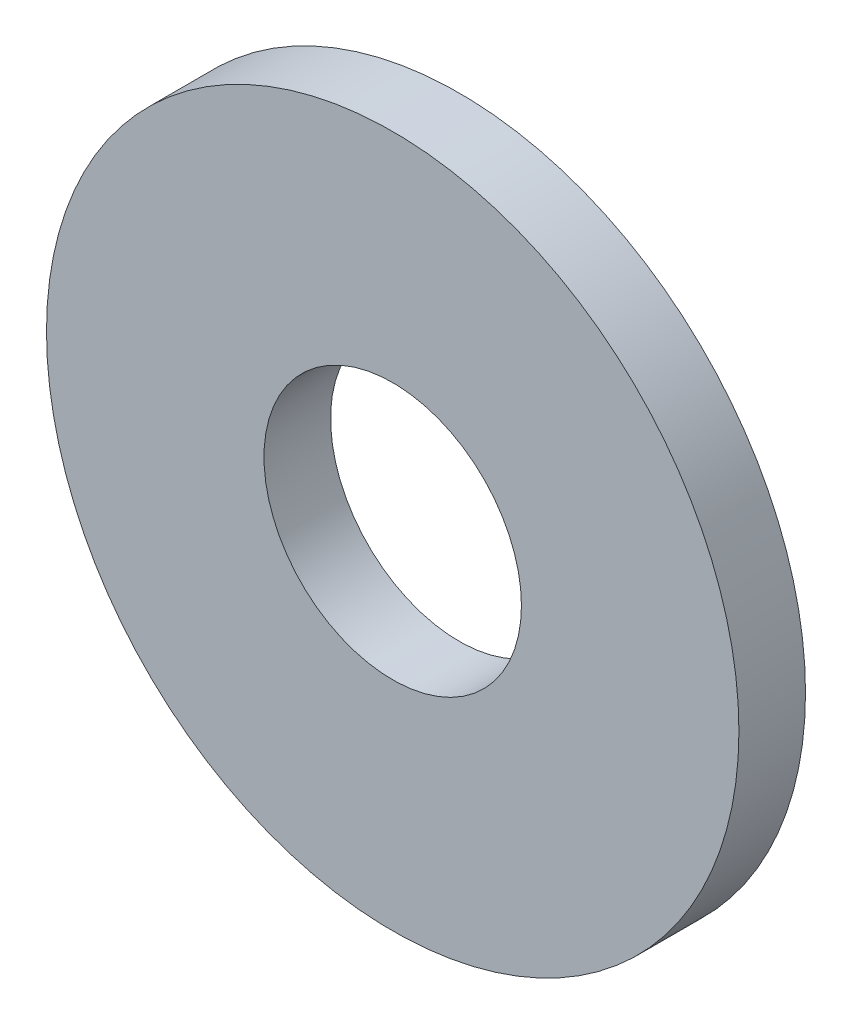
ISO-10303-21;
HEADER;
FILE_DESCRIPTION(('STEP AP214'),'2;1');
FILE_NAME('part.step','',(''),(''),'','','');
FILE_SCHEMA(('AUTOMOTIVE_DESIGN { 1 0 10303 214 1 1 1 1 }'));
ENDSEC;
DATA;
#1=APPLICATION_CONTEXT('core data for automotive mechanical design processes');
#2=APPLICATION_PROTOCOL_DEFINITION('international standard','automotive_design',2000,#1);
#3=PRODUCT_CONTEXT('',#1,'mechanical');
#4=PRODUCT('Part','Part','',(#3));
#5=PRODUCT_RELATED_PRODUCT_CATEGORY('part','',(#4));
#6=PRODUCT_DEFINITION_FORMATION('','',#4);
#7=PRODUCT_DEFINITION_CONTEXT('part definition',#1,'design');
#8=PRODUCT_DEFINITION('design','',#6,#7);
#9=PRODUCT_DEFINITION_SHAPE('','',#8);
#10=(LENGTH_UNIT() NAMED_UNIT(*) SI_UNIT(.MILLI.,.METRE.));
#11=(NAMED_UNIT(*) PLANE_ANGLE_UNIT() SI_UNIT($,.RADIAN.));
#12=(NAMED_UNIT(*) SI_UNIT($,.STERADIAN.) SOLID_ANGLE_UNIT());
#13=UNCERTAINTY_MEASURE_WITH_UNIT(LENGTH_MEASURE(1.E-05),#10,'distance_accuracy_value','');
#14=(GEOMETRIC_REPRESENTATION_CONTEXT(3) GLOBAL_UNCERTAINTY_ASSIGNED_CONTEXT((#13)) GLOBAL_UNIT_ASSIGNED_CONTEXT((#10,
#11,#12)) REPRESENTATION_CONTEXT('',''));
#15=CARTESIAN_POINT('',(0.,0.,0.));
#16=DIRECTION('',(0.,0.,1.));
#17=DIRECTION('',(1.,0.,0.));
#18=AXIS2_PLACEMENT_3D('',#15,#16,#17);
#19=CARTESIAN_POINT('',(0.,0.,0.762));
#20=DIRECTION('',(0.,0.,-1.));
#21=DIRECTION('',(-1.,0.,0.));
#22=AXIS2_PLACEMENT_3D('',#19,#20,#21);
#23=CYLINDRICAL_SURFACE('',#22,3.9624);
#24=CARTESIAN_POINT('',(0.,0.,0.762));
#25=DIRECTION('',(0.,0.,1.));
#26=DIRECTION('',(1.,0.,0.));
#27=AXIS2_PLACEMENT_3D('',#24,#25,#26);
#28=CIRCLE('',#27,3.9624);
#29=CARTESIAN_POINT('',(-3.9624,0.,0.762));
#30=VERTEX_POINT('',#29);
#31=EDGE_CURVE('E10',#30,#30,#28,.T.);
#32=CARTESIAN_POINT('',(0.,0.,0.));
#33=DIRECTION('',(0.,0.,1.));
#34=DIRECTION('',(1.,0.,0.));
#35=AXIS2_PLACEMENT_3D('',#32,#33,#34);
#36=CIRCLE('',#35,3.9624);
#37=CARTESIAN_POINT('',(-3.9624,0.,0.));
#38=VERTEX_POINT('',#37);
#39=EDGE_CURVE('E34',#38,#38,#36,.T.);
#40=CARTESIAN_POINT('',(-3.9624,0.,0.762));
#41=CARTESIAN_POINT('',(-3.9624,0.,0.7540625));
#42=CARTESIAN_POINT('',(-3.9624,0.,0.746125));
#43=CARTESIAN_POINT('',(-3.9624,0.,0.73025));
#44=CARTESIAN_POINT('',(-3.9624,0.,0.7223125));
#45=CARTESIAN_POINT('',(-3.9624,0.,0.7064375));
#46=CARTESIAN_POINT('',(-3.9624,0.,0.6985));
#47=CARTESIAN_POINT('',(-3.9624,0.,0.682625));
#48=CARTESIAN_POINT('',(-3.9624,0.,0.6746875));
#49=CARTESIAN_POINT('',(-3.9624,0.,0.6588125));
#50=CARTESIAN_POINT('',(-3.9624,0.,0.650875));
#51=CARTESIAN_POINT('',(-3.9624,0.,0.635));
#52=CARTESIAN_POINT('',(-3.9624,0.,0.6270625));
#53=CARTESIAN_POINT('',(-3.9624,0.,0.6111875));
#54=CARTESIAN_POINT('',(-3.9624,0.,0.60325));
#55=CARTESIAN_POINT('',(-3.9624,0.,0.587375));
#56=CARTESIAN_POINT('',(-3.9624,0.,0.5794375));
#57=CARTESIAN_POINT('',(-3.9624,0.,0.5635625));
#58=CARTESIAN_POINT('',(-3.9624,0.,0.555625));
#59=CARTESIAN_POINT('',(-3.9624,0.,0.53975));
#60=CARTESIAN_POINT('',(-3.9624,0.,0.5318125));
#61=CARTESIAN_POINT('',(-3.9624,0.,0.5159375));
#62=CARTESIAN_POINT('',(-3.9624,0.,0.508));
#63=CARTESIAN_POINT('',(-3.9624,0.,0.492125));
#64=CARTESIAN_POINT('',(-3.9624,0.,0.4841875));
#65=CARTESIAN_POINT('',(-3.9624,0.,0.4683125));
#66=CARTESIAN_POINT('',(-3.9624,0.,0.460375));
#67=CARTESIAN_POINT('',(-3.9624,0.,0.4445));
#68=CARTESIAN_POINT('',(-3.9624,0.,0.4365625));
#69=CARTESIAN_POINT('',(-3.9624,0.,0.4206875));
#70=CARTESIAN_POINT('',(-3.9624,0.,0.41275));
#71=CARTESIAN_POINT('',(-3.9624,0.,0.396875));
#72=CARTESIAN_POINT('',(-3.9624,0.,0.3889375));
#73=CARTESIAN_POINT('',(-3.9624,0.,0.3730625));
#74=CARTESIAN_POINT('',(-3.9624,0.,0.365125));
#75=CARTESIAN_POINT('',(-3.9624,0.,0.34925));
#76=CARTESIAN_POINT('',(-3.9624,0.,0.3413125));
#77=CARTESIAN_POINT('',(-3.9624,0.,0.3254375));
#78=CARTESIAN_POINT('',(-3.9624,0.,0.3175));
#79=CARTESIAN_POINT('',(-3.9624,0.,0.301625));
#80=CARTESIAN_POINT('',(-3.9624,0.,0.2936875));
#81=CARTESIAN_POINT('',(-3.9624,0.,0.2778125));
#82=CARTESIAN_POINT('',(-3.9624,0.,0.269875));
#83=CARTESIAN_POINT('',(-3.9624,0.,0.254));
#84=CARTESIAN_POINT('',(-3.9624,0.,0.2460625));
#85=CARTESIAN_POINT('',(-3.9624,0.,0.2301875));
#86=CARTESIAN_POINT('',(-3.9624,0.,0.22225));
#87=CARTESIAN_POINT('',(-3.9624,0.,0.206375));
#88=CARTESIAN_POINT('',(-3.9624,0.,0.1984375));
#89=CARTESIAN_POINT('',(-3.9624,0.,0.1825625));
#90=CARTESIAN_POINT('',(-3.9624,0.,0.174625));
#91=CARTESIAN_POINT('',(-3.9624,0.,0.15875));
#92=CARTESIAN_POINT('',(-3.9624,0.,0.1508125));
#93=CARTESIAN_POINT('',(-3.9624,0.,0.1349375));
#94=CARTESIAN_POINT('',(-3.9624,0.,0.127));
#95=CARTESIAN_POINT('',(-3.9624,0.,0.111125));
#96=CARTESIAN_POINT('',(-3.9624,0.,0.1031875));
#97=CARTESIAN_POINT('',(-3.9624,0.,0.0873125));
#98=CARTESIAN_POINT('',(-3.9624,0.,0.079375));
#99=CARTESIAN_POINT('',(-3.9624,0.,0.0635));
#100=CARTESIAN_POINT('',(-3.9624,0.,0.0555625));
#101=CARTESIAN_POINT('',(-3.9624,0.,0.0396875));
#102=CARTESIAN_POINT('',(-3.9624,0.,0.03175));
#103=CARTESIAN_POINT('',(-3.9624,0.,0.015875));
#104=CARTESIAN_POINT('',(-3.9624,0.,0.00793749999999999));
#105=CARTESIAN_POINT('',(-3.9624,0.,0.));
#106=B_SPLINE_CURVE_WITH_KNOTS('',3,(#40,#41,#42,#43,#44,#45,#46,#47,#48,#49,#50,#51,#52,#53,
#54,#55,#56,#57,#58,#59,#60,#61,#62,#63,#64,#65,#66,#67,#68,#69,#70,#71,#72,#73,#74,#75,#76,#77,
#78,#79,#80,#81,#82,#83,#84,#85,#86,#87,#88,#89,#90,#91,#92,#93,#94,#95,#96,#97,#98,#99,#100,
#101,#102,#103,#104,#105),.UNSPECIFIED.,.F.,.F.,(4,2,2,2,2,2,2,2,2,2,2,2,2,2,2,2,2,2,2,2,2,2,2,
2,2,2,2,2,2,2,2,2,4),(0.,0.0238125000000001,0.047625,0.0714375,0.0952500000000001,0.1190625,
0.142875,0.1666875,0.1905,0.2143125,0.238125,0.2619375,0.28575,0.3095625,0.333375,0.3571875,
0.381,0.4048125,0.428625,0.4524375,0.47625,0.5000625,0.523875,0.5476875,0.5715,0.5953125,
0.619125,0.6429375,0.66675,0.6905625,0.714375,0.7381875,0.762),.UNSPECIFIED.);
#107=EDGE_CURVE('BSEAM31',#30,#38,#106,.T.);
#108=ORIENTED_EDGE('',*,*,#31,.F.);
#109=ORIENTED_EDGE('',*,*,#39,.T.);
#110=ORIENTED_EDGE('',*,*,#107,.T.);
#111=ORIENTED_EDGE('',*,*,#107,.F.);
#112=EDGE_LOOP('',(#108,#110,#109,#111));
#113=FACE_BOUND('',#112,.T.);
#114=ADVANCED_FACE('F31',(#113),#23,.T.);
#115=CARTESIAN_POINT('',(0.,0.,0.762));
#116=DIRECTION('',(0.,0.,1.));
#117=DIRECTION('',(1.,0.,0.));
#118=AXIS2_PLACEMENT_3D('',#115,#116,#117);
#119=PLANE('',#118);
#120=CARTESIAN_POINT('',(0.,0.,0.762000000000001));
#121=DIRECTION('',(0.,0.,1.));
#122=DIRECTION('',(1.,0.,0.));
#123=AXIS2_PLACEMENT_3D('',#120,#121,#122);
#124=CIRCLE('',#123,1.47319999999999);
#125=CARTESIAN_POINT('',(1.47319999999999,0.,0.762000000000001));
#126=VERTEX_POINT('',#125);
#127=EDGE_CURVE('E45',#126,#126,#124,.T.);
#128=ORIENTED_EDGE('',*,*,#127,.F.);
#129=EDGE_LOOP('',(#128));
#130=FACE_BOUND('',#129,.T.);
#131=ORIENTED_EDGE('',*,*,#31,.T.);
#132=EDGE_LOOP('',(#131));
#133=FACE_BOUND('',#132,.T.);
#134=ADVANCED_FACE('F51',(#130,#133),#119,.T.);
#135=CARTESIAN_POINT('',(0.,0.,0.));
#136=DIRECTION('',(0.,0.,1.));
#137=DIRECTION('',(1.,0.,0.));
#138=AXIS2_PLACEMENT_3D('',#135,#136,#137);
#139=PLANE('',#138);
#140=CARTESIAN_POINT('',(0.,0.,0.));
#141=DIRECTION('',(0.,0.,1.));
#142=DIRECTION('',(1.,0.,0.));
#143=AXIS2_PLACEMENT_3D('',#140,#141,#142);
#144=CIRCLE('',#143,1.4732);
#145=CARTESIAN_POINT('',(1.4732,0.,0.));
#146=VERTEX_POINT('',#145);
#147=EDGE_CURVE('E41',#146,#146,#144,.T.);
#148=ORIENTED_EDGE('',*,*,#147,.T.);
#149=EDGE_LOOP('',(#148));
#150=FACE_BOUND('',#149,.T.);
#151=ORIENTED_EDGE('',*,*,#39,.F.);
#152=EDGE_LOOP('',(#151));
#153=FACE_BOUND('',#152,.T.);
#154=ADVANCED_FACE('F53',(#150,#153),#139,.F.);
#155=CARTESIAN_POINT('',(0.,0.,0.762));
#156=DIRECTION('',(0.,0.,1.));
#157=DIRECTION('',(1.,0.,0.));
#158=AXIS2_PLACEMENT_3D('',#155,#156,#157);
#159=CYLINDRICAL_SURFACE('',#158,1.47319999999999);
#160=ORIENTED_EDGE('',*,*,#147,.F.);
#161=EDGE_LOOP('',(#160));
#162=FACE_BOUND('',#161,.T.);
#163=ORIENTED_EDGE('',*,*,#127,.T.);
#164=EDGE_LOOP('',(#163));
#165=FACE_BOUND('',#164,.T.);
#166=ADVANCED_FACE('F49',(#162,#165),#159,.F.);
#167=CLOSED_SHELL('',(#114,#134,#154,#166));
#168=MANIFOLD_SOLID_BREP('B2',#167);
#169=ADVANCED_BREP_SHAPE_REPRESENTATION('',(#18,#168),#14);
#170=SHAPE_DEFINITION_REPRESENTATION(#9,#169);
ENDSEC;
END-ISO-10303-21;
